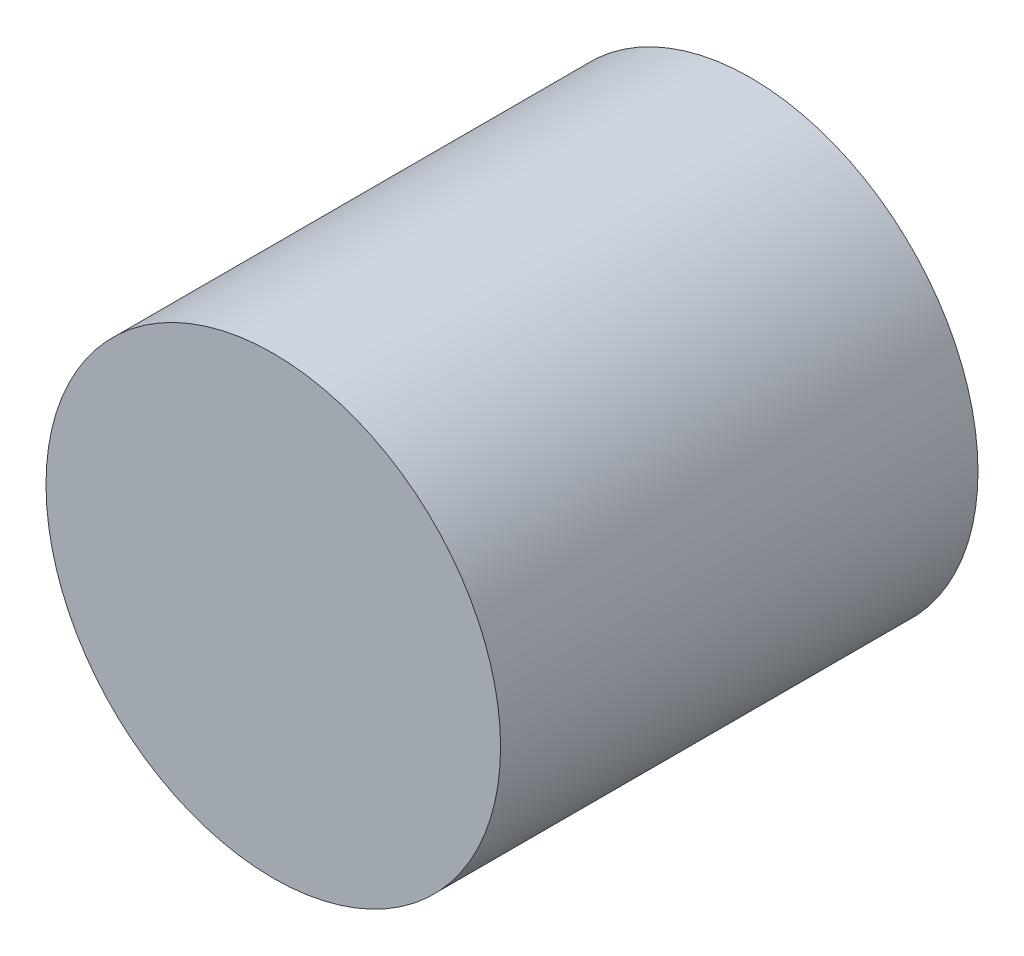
ISO-10303-21;
HEADER;
FILE_DESCRIPTION(('STEP AP214'),'2;1');
FILE_NAME('part.step','',(''),(''),'','','');
FILE_SCHEMA(('AUTOMOTIVE_DESIGN { 1 0 10303 214 1 1 1 1 }'));
ENDSEC;
DATA;
#1=APPLICATION_CONTEXT('core data for automotive mechanical design processes');
#2=APPLICATION_PROTOCOL_DEFINITION('international standard','automotive_design',2000,#1);
#3=PRODUCT_CONTEXT('',#1,'mechanical');
#4=PRODUCT('Part','Part','',(#3));
#5=PRODUCT_RELATED_PRODUCT_CATEGORY('part','',(#4));
#6=PRODUCT_DEFINITION_FORMATION('','',#4);
#7=PRODUCT_DEFINITION_CONTEXT('part definition',#1,'design');
#8=PRODUCT_DEFINITION('design','',#6,#7);
#9=PRODUCT_DEFINITION_SHAPE('','',#8);
#10=(LENGTH_UNIT() NAMED_UNIT(*) SI_UNIT(.MILLI.,.METRE.));
#11=(NAMED_UNIT(*) PLANE_ANGLE_UNIT() SI_UNIT($,.RADIAN.));
#12=(NAMED_UNIT(*) SI_UNIT($,.STERADIAN.) SOLID_ANGLE_UNIT());
#13=UNCERTAINTY_MEASURE_WITH_UNIT(LENGTH_MEASURE(1.E-05),#10,'distance_accuracy_value','');
#14=(GEOMETRIC_REPRESENTATION_CONTEXT(3) GLOBAL_UNCERTAINTY_ASSIGNED_CONTEXT((#13)) GLOBAL_UNIT_ASSIGNED_CONTEXT((#10,
#11,#12)) REPRESENTATION_CONTEXT('',''));
#15=CARTESIAN_POINT('',(0.,0.,0.));
#16=DIRECTION('',(0.,0.,1.));
#17=DIRECTION('',(1.,0.,0.));
#18=AXIS2_PLACEMENT_3D('',#15,#16,#17);
#19=CARTESIAN_POINT('',(-13.8840891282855,80.1325104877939,-11.2352139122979));
#20=DIRECTION('',(0.,0.,1.));
#21=DIRECTION('',(1.,0.,0.));
#22=AXIS2_PLACEMENT_3D('',#19,#20,#21);
#23=CYLINDRICAL_SURFACE('',#22,6.89228407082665);
#24=CARTESIAN_POINT('',(-13.8840891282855,80.1325104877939,-11.2352139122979));
#25=DIRECTION('',(0.,0.,1.));
#26=DIRECTION('',(1.,0.,0.));
#27=AXIS2_PLACEMENT_3D('',#24,#25,#26);
#28=CIRCLE('',#27,6.89228407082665);
#29=CARTESIAN_POINT('',(-6.9918050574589,80.1325104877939,-11.2352139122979));
#30=VERTEX_POINT('',#29);
#31=EDGE_CURVE('E10',#30,#30,#28,.T.);
#32=CARTESIAN_POINT('',(-13.8840891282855,80.1325104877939,3.24278608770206));
#33=DIRECTION('',(0.,0.,1.));
#34=DIRECTION('',(1.,0.,0.));
#35=AXIS2_PLACEMENT_3D('',#32,#33,#34);
#36=CIRCLE('',#35,6.89228407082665);
#37=CARTESIAN_POINT('',(-6.9918050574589,80.1325104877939,3.24278608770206));
#38=VERTEX_POINT('',#37);
#39=EDGE_CURVE('E32',#38,#38,#36,.T.);
#40=CARTESIAN_POINT('',(-6.9918050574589,80.1325104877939,-11.2352139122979));
#41=CARTESIAN_POINT('',(-6.9918050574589,80.1325104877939,-11.0844014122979));
#42=CARTESIAN_POINT('',(-6.9918050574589,80.1325104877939,-10.9335889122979));
#43=CARTESIAN_POINT('',(-6.9918050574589,80.1325104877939,-10.6319639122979));
#44=CARTESIAN_POINT('',(-6.9918050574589,80.1325104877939,-10.4811514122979));
#45=CARTESIAN_POINT('',(-6.9918050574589,80.1325104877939,-10.1795264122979));
#46=CARTESIAN_POINT('',(-6.9918050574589,80.1325104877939,-10.0287139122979));
#47=CARTESIAN_POINT('',(-6.9918050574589,80.1325104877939,-9.72708891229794));
#48=CARTESIAN_POINT('',(-6.9918050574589,80.1325104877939,-9.57627641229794));
#49=CARTESIAN_POINT('',(-6.9918050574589,80.1325104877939,-9.27465141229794));
#50=CARTESIAN_POINT('',(-6.9918050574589,80.1325104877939,-9.12383891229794));
#51=CARTESIAN_POINT('',(-6.9918050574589,80.1325104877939,-8.82221391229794));
#52=CARTESIAN_POINT('',(-6.9918050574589,80.1325104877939,-8.67140141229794));
#53=CARTESIAN_POINT('',(-6.9918050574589,80.1325104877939,-8.36977641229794));
#54=CARTESIAN_POINT('',(-6.9918050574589,80.1325104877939,-8.21896391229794));
#55=CARTESIAN_POINT('',(-6.9918050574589,80.1325104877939,-7.91733891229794));
#56=CARTESIAN_POINT('',(-6.9918050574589,80.1325104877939,-7.76652641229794));
#57=CARTESIAN_POINT('',(-6.9918050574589,80.1325104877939,-7.46490141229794));
#58=CARTESIAN_POINT('',(-6.9918050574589,80.1325104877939,-7.31408891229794));
#59=CARTESIAN_POINT('',(-6.9918050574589,80.1325104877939,-7.01246391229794));
#60=CARTESIAN_POINT('',(-6.9918050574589,80.1325104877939,-6.86165141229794));
#61=CARTESIAN_POINT('',(-6.9918050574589,80.1325104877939,-6.56002641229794));
#62=CARTESIAN_POINT('',(-6.9918050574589,80.1325104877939,-6.40921391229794));
#63=CARTESIAN_POINT('',(-6.9918050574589,80.1325104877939,-6.10758891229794));
#64=CARTESIAN_POINT('',(-6.9918050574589,80.1325104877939,-5.95677641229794));
#65=CARTESIAN_POINT('',(-6.9918050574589,80.1325104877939,-5.65515141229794));
#66=CARTESIAN_POINT('',(-6.9918050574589,80.1325104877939,-5.50433891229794));
#67=CARTESIAN_POINT('',(-6.9918050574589,80.1325104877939,-5.20271391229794));
#68=CARTESIAN_POINT('',(-6.9918050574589,80.1325104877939,-5.05190141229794));
#69=CARTESIAN_POINT('',(-6.9918050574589,80.1325104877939,-4.75027641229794));
#70=CARTESIAN_POINT('',(-6.9918050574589,80.1325104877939,-4.59946391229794));
#71=CARTESIAN_POINT('',(-6.9918050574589,80.1325104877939,-4.29783891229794));
#72=CARTESIAN_POINT('',(-6.9918050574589,80.1325104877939,-4.14702641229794));
#73=CARTESIAN_POINT('',(-6.9918050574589,80.1325104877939,-3.84540141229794));
#74=CARTESIAN_POINT('',(-6.9918050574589,80.1325104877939,-3.69458891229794));
#75=CARTESIAN_POINT('',(-6.9918050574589,80.1325104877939,-3.39296391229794));
#76=CARTESIAN_POINT('',(-6.9918050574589,80.1325104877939,-3.24215141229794));
#77=CARTESIAN_POINT('',(-6.9918050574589,80.1325104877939,-2.94052641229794));
#78=CARTESIAN_POINT('',(-6.9918050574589,80.1325104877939,-2.78971391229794));
#79=CARTESIAN_POINT('',(-6.9918050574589,80.1325104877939,-2.48808891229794));
#80=CARTESIAN_POINT('',(-6.9918050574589,80.1325104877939,-2.33727641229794));
#81=CARTESIAN_POINT('',(-6.9918050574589,80.1325104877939,-2.03565141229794));
#82=CARTESIAN_POINT('',(-6.9918050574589,80.1325104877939,-1.88483891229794));
#83=CARTESIAN_POINT('',(-6.9918050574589,80.1325104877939,-1.58321391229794));
#84=CARTESIAN_POINT('',(-6.9918050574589,80.1325104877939,-1.43240141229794));
#85=CARTESIAN_POINT('',(-6.9918050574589,80.1325104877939,-1.13077641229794));
#86=CARTESIAN_POINT('',(-6.9918050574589,80.1325104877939,-0.979963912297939));
#87=CARTESIAN_POINT('',(-6.9918050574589,80.1325104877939,-0.678338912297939));
#88=CARTESIAN_POINT('',(-6.9918050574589,80.1325104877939,-0.527526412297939));
#89=CARTESIAN_POINT('',(-6.9918050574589,80.1325104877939,-0.225901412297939));
#90=CARTESIAN_POINT('',(-6.9918050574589,80.1325104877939,-0.0750889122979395));
#91=CARTESIAN_POINT('',(-6.9918050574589,80.1325104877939,0.22653608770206));
#92=CARTESIAN_POINT('',(-6.9918050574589,80.1325104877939,0.37734858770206));
#93=CARTESIAN_POINT('',(-6.9918050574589,80.1325104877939,0.678973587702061));
#94=CARTESIAN_POINT('',(-6.9918050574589,80.1325104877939,0.829786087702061));
#95=CARTESIAN_POINT('',(-6.9918050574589,80.1325104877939,1.13141108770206));
#96=CARTESIAN_POINT('',(-6.9918050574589,80.1325104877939,1.28222358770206));
#97=CARTESIAN_POINT('',(-6.9918050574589,80.1325104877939,1.58384858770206));
#98=CARTESIAN_POINT('',(-6.9918050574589,80.1325104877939,1.73466108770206));
#99=CARTESIAN_POINT('',(-6.9918050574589,80.1325104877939,2.03628608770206));
#100=CARTESIAN_POINT('',(-6.9918050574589,80.1325104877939,2.18709858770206));
#101=CARTESIAN_POINT('',(-6.9918050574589,80.1325104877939,2.48872358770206));
#102=CARTESIAN_POINT('',(-6.9918050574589,80.1325104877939,2.63953608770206));
#103=CARTESIAN_POINT('',(-6.9918050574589,80.1325104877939,2.94116108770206));
#104=CARTESIAN_POINT('',(-6.9918050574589,80.1325104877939,3.09197358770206));
#105=CARTESIAN_POINT('',(-6.9918050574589,80.1325104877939,3.24278608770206));
#106=B_SPLINE_CURVE_WITH_KNOTS('',3,(#40,#41,#42,#43,#44,#45,#46,#47,#48,#49,#50,#51,#52,#53,
#54,#55,#56,#57,#58,#59,#60,#61,#62,#63,#64,#65,#66,#67,#68,#69,#70,#71,#72,#73,#74,#75,#76,#77,
#78,#79,#80,#81,#82,#83,#84,#85,#86,#87,#88,#89,#90,#91,#92,#93,#94,#95,#96,#97,#98,#99,#100,
#101,#102,#103,#104,#105),.UNSPECIFIED.,.F.,.F.,(4,2,2,2,2,2,2,2,2,2,2,2,2,2,2,2,2,2,2,2,2,2,2,
2,2,2,2,2,2,2,2,2,4),(0.,0.4524375,0.904874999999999,1.3573125,1.80975,2.2621875,2.714625,
3.1670625,3.6195,4.0719375,4.524375,4.9768125,5.42925,5.8816875,6.334125,6.7865625,7.239,
7.6914375,8.143875,8.5963125,9.04875,9.5011875,9.953625,10.4060625,10.8585,11.3109375,11.763375,
12.2158125,12.66825,13.1206875,13.573125,14.0255625,14.478),.UNSPECIFIED.);
#107=EDGE_CURVE('BSEAM29',#30,#38,#106,.T.);
#108=ORIENTED_EDGE('',*,*,#31,.T.);
#109=ORIENTED_EDGE('',*,*,#39,.F.);
#110=ORIENTED_EDGE('',*,*,#107,.T.);
#111=ORIENTED_EDGE('',*,*,#107,.F.);
#112=EDGE_LOOP('',(#108,#110,#109,#111));
#113=FACE_BOUND('',#112,.T.);
#114=ADVANCED_FACE('F29',(#113),#23,.T.);
#115=CARTESIAN_POINT('',(-13.8840891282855,80.1325104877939,-11.2352139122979));
#116=DIRECTION('',(0.,0.,1.));
#117=DIRECTION('',(1.,0.,0.));
#118=AXIS2_PLACEMENT_3D('',#115,#116,#117);
#119=PLANE('',#118);
#120=ORIENTED_EDGE('',*,*,#31,.F.);
#121=EDGE_LOOP('',(#120));
#122=FACE_BOUND('',#121,.T.);
#123=ADVANCED_FACE('F44',(#122),#119,.F.);
#124=CARTESIAN_POINT('',(-13.8840891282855,80.1325104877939,3.24278608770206));
#125=DIRECTION('',(0.,0.,1.));
#126=DIRECTION('',(1.,0.,0.));
#127=AXIS2_PLACEMENT_3D('',#124,#125,#126);
#128=PLANE('',#127);
#129=ORIENTED_EDGE('',*,*,#39,.T.);
#130=EDGE_LOOP('',(#129));
#131=FACE_BOUND('',#130,.T.);
#132=ADVANCED_FACE('F41',(#131),#128,.T.);
#133=CLOSED_SHELL('',(#114,#123,#132));
#134=MANIFOLD_SOLID_BREP('B2',#133);
#135=ADVANCED_BREP_SHAPE_REPRESENTATION('',(#18,#134),#14);
#136=SHAPE_DEFINITION_REPRESENTATION(#9,#135);
ENDSEC;
END-ISO-10303-21;
